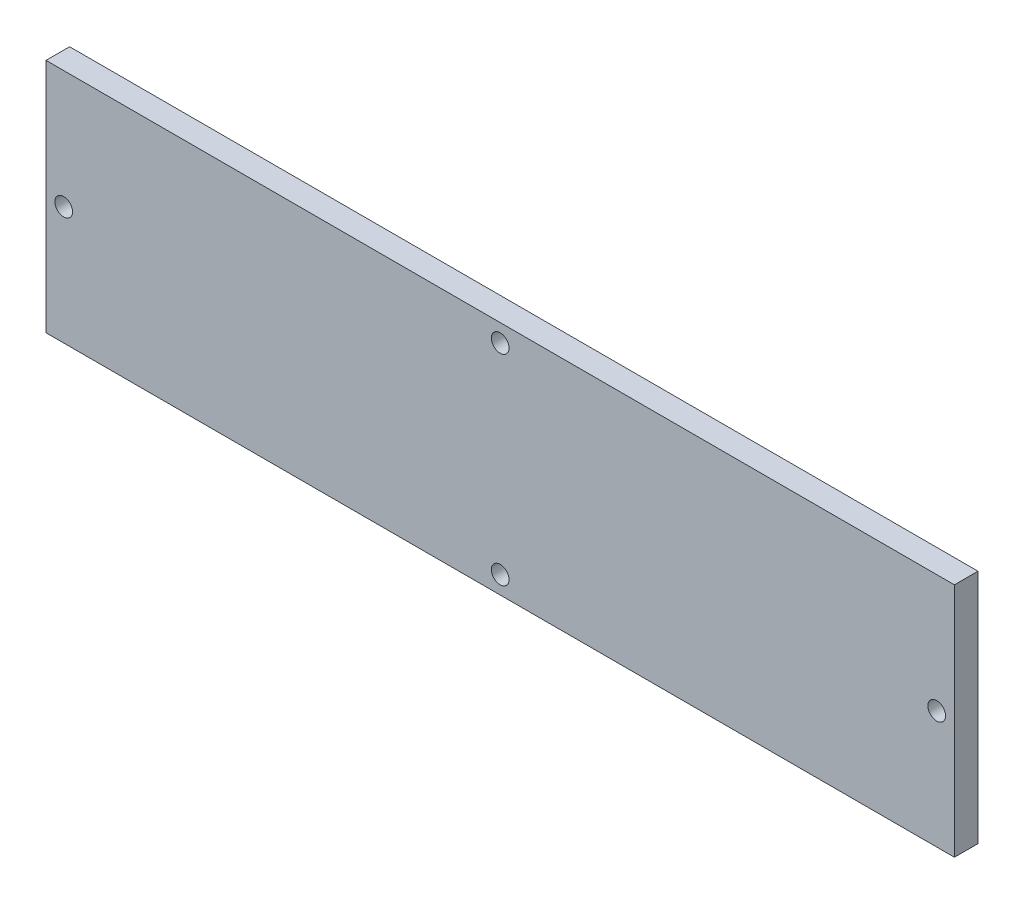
from build123d import *

# Parameters (mm, degrees)
ESQUISSE1_W             = 154
ESQUISSE1_H             = 40
BASE_EXTRUSION_DEPTH    = 6
ESQUISSE3_W             = 154
ESQUISSE3_H             = 40
ESQUISSE3_W_2           = 142
ESQUISSE3_H_2           = 28
ENL_V_MAT_EXTRU_1_DEPTH = 2
ESQUISSE4_R             = 1.5
ENL_V_MAT_EXTRU_2_DEPTH = 4


with BuildPart() as part:
    # Esquisse1 → Base-Extrusion (new body)
    with BuildSketch(Plane.XY):
        with Locations((13.832527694, 11.091339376)):
            Rectangle(ESQUISSE1_W, ESQUISSE1_H)
    extrude(amount=BASE_EXTRUSION_DEPTH)

    # Esquisse3 → Enl_v. mat.-Extru.1 (cut)
    with BuildSketch(Plane(origin=(0, 0, 0), x_dir=(-1, 0, 0), z_dir=(0, 0, -1))):
        with Locations((-13.832527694, 11.091339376)):
            Rectangle(ESQUISSE3_W, ESQUISSE3_H)
        with Locations((-13.832527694, 11.091339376)):
            Rectangle(ESQUISSE3_W_2, ESQUISSE3_H_2, mode=Mode.SUBTRACT)
    extrude(amount=-ENL_V_MAT_EXTRU_1_DEPTH, mode=Mode.SUBTRACT)

    # Esquisse4 → Enl_v. mat.-Extru.2 (cut)
    with BuildSketch(Plane.XY.offset(6)):
        with Locations((13.832527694, -5.908660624)):
            Circle(ESQUISSE4_R)
        with Locations((87.832527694, 11.091339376)):
            Circle(ESQUISSE4_R)
        with Locations((13.832527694, 28.091339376)):
            Circle(ESQUISSE4_R)
        with Locations((-60.167472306, 11.091339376)):
            Circle(ESQUISSE4_R)
    extrude(amount=-ENL_V_MAT_EXTRU_2_DEPTH, mode=Mode.SUBTRACT)


solid = part.part
